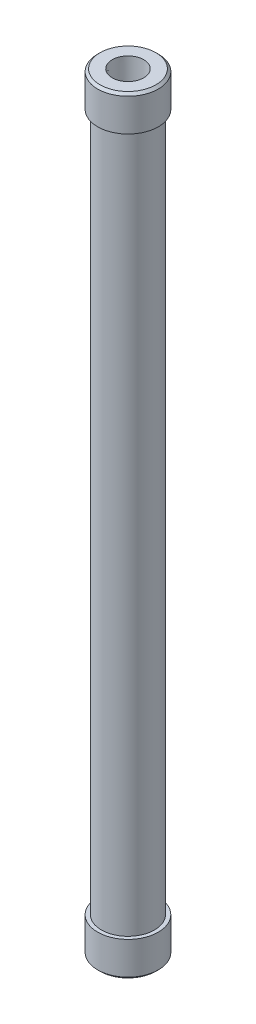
ISO-10303-21;
HEADER;
FILE_DESCRIPTION(('STEP AP214'),'2;1');
FILE_NAME('part.step','',(''),(''),'','','');
FILE_SCHEMA(('AUTOMOTIVE_DESIGN { 1 0 10303 214 1 1 1 1 }'));
ENDSEC;
DATA;
#1=APPLICATION_CONTEXT('core data for automotive mechanical design processes');
#2=APPLICATION_PROTOCOL_DEFINITION('international standard','automotive_design',2000,#1);
#3=PRODUCT_CONTEXT('',#1,'mechanical');
#4=PRODUCT('Part','Part','',(#3));
#5=PRODUCT_RELATED_PRODUCT_CATEGORY('part','',(#4));
#6=PRODUCT_DEFINITION_FORMATION('','',#4);
#7=PRODUCT_DEFINITION_CONTEXT('part definition',#1,'design');
#8=PRODUCT_DEFINITION('design','',#6,#7);
#9=PRODUCT_DEFINITION_SHAPE('','',#8);
#10=(LENGTH_UNIT() NAMED_UNIT(*) SI_UNIT(.MILLI.,.METRE.));
#11=(NAMED_UNIT(*) PLANE_ANGLE_UNIT() SI_UNIT($,.RADIAN.));
#12=(NAMED_UNIT(*) SI_UNIT($,.STERADIAN.) SOLID_ANGLE_UNIT());
#13=UNCERTAINTY_MEASURE_WITH_UNIT(LENGTH_MEASURE(1.E-05),#10,'distance_accuracy_value','');
#14=(GEOMETRIC_REPRESENTATION_CONTEXT(3) GLOBAL_UNCERTAINTY_ASSIGNED_CONTEXT((#13)) GLOBAL_UNIT_ASSIGNED_CONTEXT((#10,
#11,#12)) REPRESENTATION_CONTEXT('',''));
#15=CARTESIAN_POINT('',(0.,0.,0.));
#16=DIRECTION('',(0.,0.,1.));
#17=DIRECTION('',(1.,0.,0.));
#18=AXIS2_PLACEMENT_3D('',#15,#16,#17);
#19=CARTESIAN_POINT('',(0.,482.6,0.));
#20=DIRECTION('',(0.,-1.,0.));
#21=DIRECTION('',(0.,0.,-1.));
#22=AXIS2_PLACEMENT_3D('',#19,#20,#21);
#23=CYLINDRICAL_SURFACE('',#22,16.7005);
#24=CARTESIAN_POINT('',(0.,22.098,0.));
#25=DIRECTION('',(0.,1.,0.));
#26=DIRECTION('',(0.,0.,1.));
#27=AXIS2_PLACEMENT_3D('',#24,#25,#26);
#28=CIRCLE('',#27,16.7005);
#29=CARTESIAN_POINT('',(0.,22.0979999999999,-16.7005));
#30=VERTEX_POINT('',#29);
#31=EDGE_CURVE('E71',#30,#30,#28,.T.);
#32=CARTESIAN_POINT('',(0.,460.502,0.));
#33=DIRECTION('',(0.,1.,0.));
#34=DIRECTION('',(0.,0.,1.));
#35=AXIS2_PLACEMENT_3D('',#32,#33,#34);
#36=CIRCLE('',#35,16.7005);
#37=CARTESIAN_POINT('',(0.,460.502,-16.7005));
#38=VERTEX_POINT('',#37);
#39=EDGE_CURVE('E53',#38,#38,#36,.T.);
#40=CARTESIAN_POINT('',(0.,22.0979999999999,-16.7005));
#41=CARTESIAN_POINT('',(0.,26.6647083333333,-16.7005));
#42=CARTESIAN_POINT('',(0.,31.2314166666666,-16.7005));
#43=CARTESIAN_POINT('',(0.,40.3648333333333,-16.7005));
#44=CARTESIAN_POINT('',(0.,44.9315416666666,-16.7005));
#45=CARTESIAN_POINT('',(0.,54.0649583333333,-16.7005));
#46=CARTESIAN_POINT('',(0.,58.6316666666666,-16.7005));
#47=CARTESIAN_POINT('',(0.,67.7650833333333,-16.7005));
#48=CARTESIAN_POINT('',(0.,72.3317916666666,-16.7005));
#49=CARTESIAN_POINT('',(0.,81.4652083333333,-16.7005));
#50=CARTESIAN_POINT('',(0.,86.0319166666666,-16.7005));
#51=CARTESIAN_POINT('',(0.,95.1653333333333,-16.7005));
#52=CARTESIAN_POINT('',(0.,99.7320416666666,-16.7005));
#53=CARTESIAN_POINT('',(0.,108.865458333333,-16.7005));
#54=CARTESIAN_POINT('',(0.,113.432166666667,-16.7005));
#55=CARTESIAN_POINT('',(0.,122.565583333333,-16.7005));
#56=CARTESIAN_POINT('',(0.,127.132291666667,-16.7005));
#57=CARTESIAN_POINT('',(0.,136.265708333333,-16.7005));
#58=CARTESIAN_POINT('',(0.,140.832416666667,-16.7005));
#59=CARTESIAN_POINT('',(0.,149.965833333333,-16.7005));
#60=CARTESIAN_POINT('',(0.,154.532541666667,-16.7005));
#61=CARTESIAN_POINT('',(0.,163.665958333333,-16.7005));
#62=CARTESIAN_POINT('',(0.,168.232666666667,-16.7005));
#63=CARTESIAN_POINT('',(0.,177.366083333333,-16.7005));
#64=CARTESIAN_POINT('',(0.,181.932791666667,-16.7005));
#65=CARTESIAN_POINT('',(0.,191.066208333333,-16.7005));
#66=CARTESIAN_POINT('',(0.,195.632916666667,-16.7005));
#67=CARTESIAN_POINT('',(0.,204.766333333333,-16.7005));
#68=CARTESIAN_POINT('',(0.,209.333041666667,-16.7005));
#69=CARTESIAN_POINT('',(0.,218.466458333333,-16.7005));
#70=CARTESIAN_POINT('',(0.,223.033166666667,-16.7005));
#71=CARTESIAN_POINT('',(0.,232.166583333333,-16.7005));
#72=CARTESIAN_POINT('',(0.,236.733291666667,-16.7005));
#73=CARTESIAN_POINT('',(0.,245.866708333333,-16.7005));
#74=CARTESIAN_POINT('',(0.,250.433416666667,-16.7005));
#75=CARTESIAN_POINT('',(0.,259.566833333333,-16.7005));
#76=CARTESIAN_POINT('',(0.,264.133541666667,-16.7005));
#77=CARTESIAN_POINT('',(0.,273.266958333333,-16.7005));
#78=CARTESIAN_POINT('',(0.,277.833666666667,-16.7005));
#79=CARTESIAN_POINT('',(0.,286.967083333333,-16.7005));
#80=CARTESIAN_POINT('',(0.,291.533791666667,-16.7005));
#81=CARTESIAN_POINT('',(0.,300.667208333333,-16.7005));
#82=CARTESIAN_POINT('',(0.,305.233916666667,-16.7005));
#83=CARTESIAN_POINT('',(0.,314.367333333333,-16.7005));
#84=CARTESIAN_POINT('',(0.,318.934041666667,-16.7005));
#85=CARTESIAN_POINT('',(0.,328.067458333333,-16.7005));
#86=CARTESIAN_POINT('',(0.,332.634166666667,-16.7005));
#87=CARTESIAN_POINT('',(0.,341.767583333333,-16.7005));
#88=CARTESIAN_POINT('',(0.,346.334291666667,-16.7005));
#89=CARTESIAN_POINT('',(0.,355.467708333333,-16.7005));
#90=CARTESIAN_POINT('',(0.,360.034416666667,-16.7005));
#91=CARTESIAN_POINT('',(0.,369.167833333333,-16.7005));
#92=CARTESIAN_POINT('',(0.,373.734541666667,-16.7005));
#93=CARTESIAN_POINT('',(0.,382.867958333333,-16.7005));
#94=CARTESIAN_POINT('',(0.,387.434666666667,-16.7005));
#95=CARTESIAN_POINT('',(0.,396.568083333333,-16.7005));
#96=CARTESIAN_POINT('',(0.,401.134791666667,-16.7005));
#97=CARTESIAN_POINT('',(0.,410.268208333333,-16.7005));
#98=CARTESIAN_POINT('',(0.,414.834916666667,-16.7005));
#99=CARTESIAN_POINT('',(0.,423.968333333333,-16.7005));
#100=CARTESIAN_POINT('',(0.,428.535041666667,-16.7005));
#101=CARTESIAN_POINT('',(0.,437.668458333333,-16.7005));
#102=CARTESIAN_POINT('',(0.,442.235166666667,-16.7005));
#103=CARTESIAN_POINT('',(0.,451.368583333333,-16.7005));
#104=CARTESIAN_POINT('',(0.,455.935291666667,-16.7005));
#105=CARTESIAN_POINT('',(0.,460.502,-16.7005));
#106=B_SPLINE_CURVE_WITH_KNOTS('',3,(#40,#41,#42,#43,#44,#45,#46,#47,#48,#49,#50,#51,#52,#53,
#54,#55,#56,#57,#58,#59,#60,#61,#62,#63,#64,#65,#66,#67,#68,#69,#70,#71,#72,#73,#74,#75,#76,#77,
#78,#79,#80,#81,#82,#83,#84,#85,#86,#87,#88,#89,#90,#91,#92,#93,#94,#95,#96,#97,#98,#99,#100,
#101,#102,#103,#104,#105),.UNSPECIFIED.,.F.,.F.,(4,2,2,2,2,2,2,2,2,2,2,2,2,2,2,2,2,2,2,2,2,2,2,
2,2,2,2,2,2,2,2,2,4),(0.,13.700125,27.40025,41.100375,54.8005,68.500625,82.20075,95.900875,
109.601,123.301125,137.00125,150.701375,164.4015,178.101625,191.80175,205.501875,219.202,
232.902125,246.60225,260.302375,274.0025,287.702625,301.40275,315.102875,328.803,342.503125,
356.20325,369.903375,383.6035,397.303625,411.00375,424.703875,438.404),.UNSPECIFIED.);
#107=EDGE_CURVE('BSEAM33',#30,#38,#106,.T.);
#108=ORIENTED_EDGE('',*,*,#31,.T.);
#109=ORIENTED_EDGE('',*,*,#39,.F.);
#110=ORIENTED_EDGE('',*,*,#107,.T.);
#111=ORIENTED_EDGE('',*,*,#107,.F.);
#112=EDGE_LOOP('',(#108,#110,#109,#111));
#113=FACE_BOUND('',#112,.T.);
#114=ADVANCED_FACE('F33',(#113),#23,.T.);
#115=CARTESIAN_POINT('',(0.,22.098,0.));
#116=DIRECTION('',(0.,1.,0.));
#117=DIRECTION('',(0.,0.,1.));
#118=AXIS2_PLACEMENT_3D('',#115,#116,#117);
#119=PLANE('',#118);
#120=CARTESIAN_POINT('',(0.,22.098,0.));
#121=DIRECTION('',(0.,1.,0.));
#122=DIRECTION('',(0.,0.,1.));
#123=AXIS2_PLACEMENT_3D('',#120,#121,#122);
#124=CIRCLE('',#123,19.05);
#125=CARTESIAN_POINT('',(0.,22.098,19.05));
#126=VERTEX_POINT('',#125);
#127=EDGE_CURVE('E67',#126,#126,#124,.T.);
#128=ORIENTED_EDGE('',*,*,#127,.T.);
#129=EDGE_LOOP('',(#128));
#130=FACE_BOUND('',#129,.T.);
#131=ORIENTED_EDGE('',*,*,#31,.F.);
#132=EDGE_LOOP('',(#131));
#133=FACE_BOUND('',#132,.T.);
#134=ADVANCED_FACE('F115',(#130,#133),#119,.T.);
#135=CARTESIAN_POINT('',(0.,22.098,0.));
#136=DIRECTION('',(0.,-1.,0.));
#137=DIRECTION('',(0.,0.,-1.));
#138=AXIS2_PLACEMENT_3D('',#135,#136,#137);
#139=CYLINDRICAL_SURFACE('',#138,19.05);
#140=CARTESIAN_POINT('',(0.,1.52400000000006,0.));
#141=DIRECTION('',(0.,1.,0.));
#142=DIRECTION('',(0.,0.,1.));
#143=AXIS2_PLACEMENT_3D('',#140,#141,#142);
#144=CIRCLE('',#143,19.05);
#145=CARTESIAN_POINT('',(0.,1.52400000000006,19.05));
#146=VERTEX_POINT('',#145);
#147=EDGE_CURVE('E48',#146,#146,#144,.T.);
#148=ORIENTED_EDGE('',*,*,#147,.T.);
#149=EDGE_LOOP('',(#148));
#150=FACE_BOUND('',#149,.T.);
#151=ORIENTED_EDGE('',*,*,#127,.F.);
#152=EDGE_LOOP('',(#151));
#153=FACE_BOUND('',#152,.T.);
#154=ADVANCED_FACE('F121',(#150,#153),#139,.T.);
#155=CARTESIAN_POINT('',(0.,0.,0.));
#156=DIRECTION('',(0.,1.,0.));
#157=DIRECTION('',(0.,0.,1.));
#158=AXIS2_PLACEMENT_3D('',#155,#156,#157);
#159=PLANE('',#158);
#160=CARTESIAN_POINT('',(0.,0.,0.));
#161=DIRECTION('',(0.,1.,0.));
#162=DIRECTION('',(0.,0.,1.));
#163=AXIS2_PLACEMENT_3D('',#160,#161,#162);
#164=CIRCLE('',#163,17.5259999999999);
#165=CARTESIAN_POINT('',(0.,0.,17.5259999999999));
#166=VERTEX_POINT('',#165);
#167=EDGE_CURVE('E44',#166,#166,#164,.F.);
#168=ORIENTED_EDGE('',*,*,#167,.T.);
#169=EDGE_LOOP('',(#168));
#170=FACE_BOUND('',#169,.T.);
#171=CARTESIAN_POINT('',(0.,0.,0.));
#172=DIRECTION('',(0.,-1.,0.));
#173=DIRECTION('',(0.,0.,-1.));
#174=AXIS2_PLACEMENT_3D('',#171,#172,#173);
#175=CIRCLE('',#174,9.896063);
#176=CARTESIAN_POINT('',(0.,0.,-9.896063));
#177=VERTEX_POINT('',#176);
#178=EDGE_CURVE('E57',#177,#177,#175,.T.);
#179=ORIENTED_EDGE('',*,*,#178,.F.);
#180=EDGE_LOOP('',(#179));
#181=FACE_BOUND('',#180,.T.);
#182=ADVANCED_FACE('F126',(#170,#181),#159,.F.);
#183=CARTESIAN_POINT('',(0.,460.502,0.));
#184=DIRECTION('',(0.,1.,0.));
#185=DIRECTION('',(0.,0.,1.));
#186=AXIS2_PLACEMENT_3D('',#183,#184,#185);
#187=PLANE('',#186);
#188=CARTESIAN_POINT('',(0.,460.502,0.));
#189=DIRECTION('',(0.,1.,0.));
#190=DIRECTION('',(0.,0.,1.));
#191=AXIS2_PLACEMENT_3D('',#188,#189,#190);
#192=CIRCLE('',#191,19.05);
#193=CARTESIAN_POINT('',(0.,460.502,19.05));
#194=VERTEX_POINT('',#193);
#195=EDGE_CURVE('E62',#194,#194,#192,.T.);
#196=ORIENTED_EDGE('',*,*,#195,.F.);
#197=EDGE_LOOP('',(#196));
#198=FACE_BOUND('',#197,.T.);
#199=ORIENTED_EDGE('',*,*,#39,.T.);
#200=EDGE_LOOP('',(#199));
#201=FACE_BOUND('',#200,.T.);
#202=ADVANCED_FACE('F110',(#198,#201),#187,.F.);
#203=CARTESIAN_POINT('',(0.,460.502,0.));
#204=DIRECTION('',(0.,1.,0.));
#205=DIRECTION('',(0.,0.,1.));
#206=AXIS2_PLACEMENT_3D('',#203,#204,#205);
#207=CYLINDRICAL_SURFACE('',#206,19.05);
#208=CARTESIAN_POINT('',(0.,481.076,0.));
#209=DIRECTION('',(0.,1.,0.));
#210=DIRECTION('',(0.,0.,1.));
#211=AXIS2_PLACEMENT_3D('',#208,#209,#210);
#212=CIRCLE('',#211,19.05);
#213=CARTESIAN_POINT('',(0.,481.076,-19.05));
#214=VERTEX_POINT('',#213);
#215=EDGE_CURVE('E10',#214,#214,#212,.F.);
#216=ORIENTED_EDGE('',*,*,#215,.T.);
#217=EDGE_LOOP('',(#216));
#218=FACE_BOUND('',#217,.T.);
#219=ORIENTED_EDGE('',*,*,#195,.T.);
#220=EDGE_LOOP('',(#219));
#221=FACE_BOUND('',#220,.T.);
#222=ADVANCED_FACE('F101',(#218,#221),#207,.T.);
#223=CARTESIAN_POINT('',(0.,482.6,0.));
#224=DIRECTION('',(0.,1.,0.));
#225=DIRECTION('',(0.,0.,1.));
#226=AXIS2_PLACEMENT_3D('',#223,#224,#225);
#227=PLANE('',#226);
#228=CARTESIAN_POINT('',(0.,482.6,0.));
#229=DIRECTION('',(0.,1.,0.));
#230=DIRECTION('',(0.,0.,1.));
#231=AXIS2_PLACEMENT_3D('',#228,#229,#230);
#232=CIRCLE('',#231,17.526);
#233=CARTESIAN_POINT('',(0.,482.6,-17.526));
#234=VERTEX_POINT('',#233);
#235=EDGE_CURVE('E40',#234,#234,#232,.T.);
#236=ORIENTED_EDGE('',*,*,#235,.T.);
#237=EDGE_LOOP('',(#236));
#238=FACE_BOUND('',#237,.T.);
#239=CARTESIAN_POINT('',(0.,482.6,0.));
#240=DIRECTION('',(0.,1.,0.));
#241=DIRECTION('',(0.,0.,1.));
#242=AXIS2_PLACEMENT_3D('',#239,#240,#241);
#243=CIRCLE('',#242,9.896063);
#244=CARTESIAN_POINT('',(0.,482.6,9.896063));
#245=VERTEX_POINT('',#244);
#246=EDGE_CURVE('E92',#245,#245,#243,.T.);
#247=ORIENTED_EDGE('',*,*,#246,.F.);
#248=EDGE_LOOP('',(#247));
#249=FACE_BOUND('',#248,.T.);
#250=ADVANCED_FACE('F98',(#238,#249),#227,.T.);
#251=CARTESIAN_POINT('',(0.,0.,0.));
#252=DIRECTION('',(0.,-1.,0.));
#253=DIRECTION('',(0.,0.,-1.));
#254=AXIS2_PLACEMENT_3D('',#251,#252,#253);
#255=CYLINDRICAL_SURFACE('',#254,8.75);
#256=CARTESIAN_POINT('',(0.,22.098,0.));
#257=DIRECTION('',(0.,1.,0.));
#258=DIRECTION('',(0.,0.,1.));
#259=AXIS2_PLACEMENT_3D('',#256,#257,#258);
#260=CIRCLE('',#259,8.75);
#261=CARTESIAN_POINT('',(0.,22.098,8.75));
#262=VERTEX_POINT('',#261);
#263=EDGE_CURVE('E59',#262,#262,#260,.T.);
#264=ORIENTED_EDGE('',*,*,#263,.T.);
#265=EDGE_LOOP('',(#264));
#266=FACE_BOUND('',#265,.T.);
#267=CARTESIAN_POINT('',(0.,14.986,0.));
#268=DIRECTION('',(0.,-1.,0.));
#269=DIRECTION('',(0.,0.,-1.));
#270=AXIS2_PLACEMENT_3D('',#267,#268,#269);
#271=CIRCLE('',#270,8.75);
#272=CARTESIAN_POINT('',(0.,14.986,-8.75));
#273=VERTEX_POINT('',#272);
#274=EDGE_CURVE('E63',#273,#273,#271,.T.);
#275=ORIENTED_EDGE('',*,*,#274,.T.);
#276=EDGE_LOOP('',(#275));
#277=FACE_BOUND('',#276,.T.);
#278=ADVANCED_FACE('F100',(#266,#277),#255,.F.);
#279=CARTESIAN_POINT('',(8.75,14.986,0.));
#280=DIRECTION('',(0.,1.,0.));
#281=DIRECTION('',(0.,0.,1.));
#282=AXIS2_PLACEMENT_3D('',#279,#280,#281);
#283=PLANE('',#282);
#284=ORIENTED_EDGE('',*,*,#274,.F.);
#285=EDGE_LOOP('',(#284));
#286=FACE_BOUND('',#285,.T.);
#287=CARTESIAN_POINT('',(0.,14.986,0.));
#288=DIRECTION('',(0.,-1.,0.));
#289=DIRECTION('',(0.,0.,-1.));
#290=AXIS2_PLACEMENT_3D('',#287,#288,#289);
#291=CIRCLE('',#290,9.42825071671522);
#292=CARTESIAN_POINT('',(0.,14.986,-9.42825071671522));
#293=VERTEX_POINT('',#292);
#294=EDGE_CURVE('E82',#293,#293,#291,.T.);
#295=ORIENTED_EDGE('',*,*,#294,.T.);
#296=EDGE_LOOP('',(#295));
#297=FACE_BOUND('',#296,.T.);
#298=ADVANCED_FACE('F107',(#286,#297),#283,.F.);
#299=CARTESIAN_POINT('',(0.,0.,0.));
#300=DIRECTION('',(0.,-1.,0.));
#301=DIRECTION('',(0.,0.,-1.));
#302=AXIS2_PLACEMENT_3D('',#299,#300,#301);
#303=CONICAL_SURFACE('',#302,9.896063,0.0312064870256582);
#304=ORIENTED_EDGE('',*,*,#294,.F.);
#305=EDGE_LOOP('',(#304));
#306=FACE_BOUND('',#305,.T.);
#307=ORIENTED_EDGE('',*,*,#178,.T.);
#308=EDGE_LOOP('',(#307));
#309=FACE_BOUND('',#308,.T.);
#310=ADVANCED_FACE('F163',(#306,#309),#303,.F.);
#311=ORIENTED_EDGE('',*,*,#263,.F.);
#312=EDGE_LOOP('',(#311));
#313=FACE_BOUND('',#312,.T.);
#314=CARTESIAN_POINT('',(0.,22.098,0.));
#315=DIRECTION('',(0.,1.,0.));
#316=DIRECTION('',(0.,0.,1.));
#317=AXIS2_PLACEMENT_3D('',#314,#315,#316);
#318=CIRCLE('',#317,13.1445);
#319=CARTESIAN_POINT('',(0.,22.0979999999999,-13.1445));
#320=VERTEX_POINT('',#319);
#321=EDGE_CURVE('E68',#320,#320,#318,.T.);
#322=ORIENTED_EDGE('',*,*,#321,.T.);
#323=EDGE_LOOP('',(#322));
#324=FACE_BOUND('',#323,.T.);
#325=ADVANCED_FACE('F124',(#313,#324),#119,.T.);
#326=CARTESIAN_POINT('',(0.,482.6,0.));
#327=DIRECTION('',(0.,-1.,0.));
#328=DIRECTION('',(0.,0.,-1.));
#329=AXIS2_PLACEMENT_3D('',#326,#327,#328);
#330=CYLINDRICAL_SURFACE('',#329,13.1445);
#331=CARTESIAN_POINT('',(0.,460.502,0.));
#332=DIRECTION('',(0.,1.,0.));
#333=DIRECTION('',(0.,0.,1.));
#334=AXIS2_PLACEMENT_3D('',#331,#332,#333);
#335=CIRCLE('',#334,13.1445);
#336=CARTESIAN_POINT('',(0.,460.502,-13.1445));
#337=VERTEX_POINT('',#336);
#338=EDGE_CURVE('E64',#337,#337,#335,.T.);
#339=CARTESIAN_POINT('',(0.,22.0979999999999,-13.1445));
#340=CARTESIAN_POINT('',(0.,26.6647083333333,-13.1445));
#341=CARTESIAN_POINT('',(0.,31.2314166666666,-13.1445));
#342=CARTESIAN_POINT('',(0.,40.3648333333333,-13.1445));
#343=CARTESIAN_POINT('',(0.,44.9315416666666,-13.1445));
#344=CARTESIAN_POINT('',(0.,54.0649583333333,-13.1445));
#345=CARTESIAN_POINT('',(0.,58.6316666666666,-13.1445));
#346=CARTESIAN_POINT('',(0.,67.7650833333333,-13.1445));
#347=CARTESIAN_POINT('',(0.,72.3317916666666,-13.1445));
#348=CARTESIAN_POINT('',(0.,81.4652083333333,-13.1445));
#349=CARTESIAN_POINT('',(0.,86.0319166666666,-13.1445));
#350=CARTESIAN_POINT('',(0.,95.1653333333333,-13.1445));
#351=CARTESIAN_POINT('',(0.,99.7320416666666,-13.1445));
#352=CARTESIAN_POINT('',(0.,108.865458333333,-13.1445));
#353=CARTESIAN_POINT('',(0.,113.432166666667,-13.1445));
#354=CARTESIAN_POINT('',(0.,122.565583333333,-13.1445));
#355=CARTESIAN_POINT('',(0.,127.132291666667,-13.1445));
#356=CARTESIAN_POINT('',(0.,136.265708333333,-13.1445));
#357=CARTESIAN_POINT('',(0.,140.832416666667,-13.1445));
#358=CARTESIAN_POINT('',(0.,149.965833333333,-13.1445));
#359=CARTESIAN_POINT('',(0.,154.532541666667,-13.1445));
#360=CARTESIAN_POINT('',(0.,163.665958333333,-13.1445));
#361=CARTESIAN_POINT('',(0.,168.232666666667,-13.1445));
#362=CARTESIAN_POINT('',(0.,177.366083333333,-13.1445));
#363=CARTESIAN_POINT('',(0.,181.932791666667,-13.1445));
#364=CARTESIAN_POINT('',(0.,191.066208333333,-13.1445));
#365=CARTESIAN_POINT('',(0.,195.632916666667,-13.1445));
#366=CARTESIAN_POINT('',(0.,204.766333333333,-13.1445));
#367=CARTESIAN_POINT('',(0.,209.333041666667,-13.1445));
#368=CARTESIAN_POINT('',(0.,218.466458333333,-13.1445));
#369=CARTESIAN_POINT('',(0.,223.033166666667,-13.1445));
#370=CARTESIAN_POINT('',(0.,232.166583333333,-13.1445));
#371=CARTESIAN_POINT('',(0.,236.733291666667,-13.1445));
#372=CARTESIAN_POINT('',(0.,245.866708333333,-13.1445));
#373=CARTESIAN_POINT('',(0.,250.433416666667,-13.1445));
#374=CARTESIAN_POINT('',(0.,259.566833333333,-13.1445));
#375=CARTESIAN_POINT('',(0.,264.133541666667,-13.1445));
#376=CARTESIAN_POINT('',(0.,273.266958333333,-13.1445));
#377=CARTESIAN_POINT('',(0.,277.833666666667,-13.1445));
#378=CARTESIAN_POINT('',(0.,286.967083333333,-13.1445));
#379=CARTESIAN_POINT('',(0.,291.533791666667,-13.1445));
#380=CARTESIAN_POINT('',(0.,300.667208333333,-13.1445));
#381=CARTESIAN_POINT('',(0.,305.233916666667,-13.1445));
#382=CARTESIAN_POINT('',(0.,314.367333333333,-13.1445));
#383=CARTESIAN_POINT('',(0.,318.934041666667,-13.1445));
#384=CARTESIAN_POINT('',(0.,328.067458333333,-13.1445));
#385=CARTESIAN_POINT('',(0.,332.634166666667,-13.1445));
#386=CARTESIAN_POINT('',(0.,341.767583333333,-13.1445));
#387=CARTESIAN_POINT('',(0.,346.334291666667,-13.1445));
#388=CARTESIAN_POINT('',(0.,355.467708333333,-13.1445));
#389=CARTESIAN_POINT('',(0.,360.034416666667,-13.1445));
#390=CARTESIAN_POINT('',(0.,369.167833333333,-13.1445));
#391=CARTESIAN_POINT('',(0.,373.734541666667,-13.1445));
#392=CARTESIAN_POINT('',(0.,382.867958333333,-13.1445));
#393=CARTESIAN_POINT('',(0.,387.434666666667,-13.1445));
#394=CARTESIAN_POINT('',(0.,396.568083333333,-13.1445));
#395=CARTESIAN_POINT('',(0.,401.134791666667,-13.1445));
#396=CARTESIAN_POINT('',(0.,410.268208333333,-13.1445));
#397=CARTESIAN_POINT('',(0.,414.834916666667,-13.1445));
#398=CARTESIAN_POINT('',(0.,423.968333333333,-13.1445));
#399=CARTESIAN_POINT('',(0.,428.535041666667,-13.1445));
#400=CARTESIAN_POINT('',(0.,437.668458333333,-13.1445));
#401=CARTESIAN_POINT('',(0.,442.235166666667,-13.1445));
#402=CARTESIAN_POINT('',(0.,451.368583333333,-13.1445));
#403=CARTESIAN_POINT('',(0.,455.935291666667,-13.1445));
#404=CARTESIAN_POINT('',(0.,460.502,-13.1445));
#405=B_SPLINE_CURVE_WITH_KNOTS('',3,(#339,#340,#341,#342,#343,#344,#345,#346,#347,#348,#349,
#350,#351,#352,#353,#354,#355,#356,#357,#358,#359,#360,#361,#362,#363,#364,#365,#366,#367,#368,
#369,#370,#371,#372,#373,#374,#375,#376,#377,#378,#379,#380,#381,#382,#383,#384,#385,#386,#387,
#388,#389,#390,#391,#392,#393,#394,#395,#396,#397,#398,#399,#400,#401,#402,#403,#404),
.UNSPECIFIED.,.F.,.F.,(4,2,2,2,2,2,2,2,2,2,2,2,2,2,2,2,2,2,2,2,2,2,2,2,2,2,2,2,2,2,2,2,4),(0.,
13.700125,27.40025,41.100375,54.8005,68.500625,82.20075,95.900875,109.601,123.301125,137.00125,
150.701375,164.4015,178.101625,191.80175,205.501875,219.202,232.902125,246.60225,260.302375,
274.0025,287.702625,301.40275,315.102875,328.803,342.503125,356.20325,369.903375,383.6035,
397.303625,411.00375,424.703875,438.404),.UNSPECIFIED.);
#406=EDGE_CURVE('BSEAM152',#320,#337,#405,.T.);
#407=ORIENTED_EDGE('',*,*,#321,.F.);
#408=ORIENTED_EDGE('',*,*,#338,.T.);
#409=ORIENTED_EDGE('',*,*,#406,.T.);
#410=ORIENTED_EDGE('',*,*,#406,.F.);
#411=EDGE_LOOP('',(#407,#409,#408,#410));
#412=FACE_BOUND('',#411,.T.);
#413=ADVANCED_FACE('F152',(#412),#330,.F.);
#414=CARTESIAN_POINT('',(0.,460.502,0.));
#415=DIRECTION('',(0.,1.,0.));
#416=DIRECTION('',(0.,0.,1.));
#417=AXIS2_PLACEMENT_3D('',#414,#415,#416);
#418=CIRCLE('',#417,8.75);
#419=CARTESIAN_POINT('',(0.,460.502,8.75));
#420=VERTEX_POINT('',#419);
#421=EDGE_CURVE('E54',#420,#420,#418,.T.);
#422=ORIENTED_EDGE('',*,*,#421,.T.);
#423=EDGE_LOOP('',(#422));
#424=FACE_BOUND('',#423,.T.);
#425=ORIENTED_EDGE('',*,*,#338,.F.);
#426=EDGE_LOOP('',(#425));
#427=FACE_BOUND('',#426,.T.);
#428=ADVANCED_FACE('F154',(#424,#427),#187,.F.);
#429=CARTESIAN_POINT('',(0.,482.6,0.));
#430=DIRECTION('',(0.,1.,0.));
#431=DIRECTION('',(0.,0.,1.));
#432=AXIS2_PLACEMENT_3D('',#429,#430,#431);
#433=CYLINDRICAL_SURFACE('',#432,8.75);
#434=CARTESIAN_POINT('',(0.,467.614,0.));
#435=DIRECTION('',(0.,1.,0.));
#436=DIRECTION('',(0.,0.,1.));
#437=AXIS2_PLACEMENT_3D('',#434,#435,#436);
#438=CIRCLE('',#437,8.75);
#439=CARTESIAN_POINT('',(0.,467.614,8.75));
#440=VERTEX_POINT('',#439);
#441=EDGE_CURVE('E58',#440,#440,#438,.T.);
#442=ORIENTED_EDGE('',*,*,#441,.T.);
#443=EDGE_LOOP('',(#442));
#444=FACE_BOUND('',#443,.T.);
#445=ORIENTED_EDGE('',*,*,#421,.F.);
#446=EDGE_LOOP('',(#445));
#447=FACE_BOUND('',#446,.T.);
#448=ADVANCED_FACE('F160',(#444,#447),#433,.F.);
#449=CARTESIAN_POINT('',(8.75,467.614,0.));
#450=DIRECTION('',(0.,-1.,0.));
#451=DIRECTION('',(0.,0.,-1.));
#452=AXIS2_PLACEMENT_3D('',#449,#450,#451);
#453=PLANE('',#452);
#454=ORIENTED_EDGE('',*,*,#441,.F.);
#455=EDGE_LOOP('',(#454));
#456=FACE_BOUND('',#455,.T.);
#457=CARTESIAN_POINT('',(0.,467.614,0.));
#458=DIRECTION('',(0.,1.,0.));
#459=DIRECTION('',(0.,0.,1.));
#460=AXIS2_PLACEMENT_3D('',#457,#458,#459);
#461=CIRCLE('',#460,9.42825071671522);
#462=CARTESIAN_POINT('',(0.,467.614,9.42825071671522));
#463=VERTEX_POINT('',#462);
#464=EDGE_CURVE('E89',#463,#463,#461,.T.);
#465=ORIENTED_EDGE('',*,*,#464,.T.);
#466=EDGE_LOOP('',(#465));
#467=FACE_BOUND('',#466,.T.);
#468=ADVANCED_FACE('F135',(#456,#467),#453,.F.);
#469=CARTESIAN_POINT('',(0.,482.6,0.));
#470=DIRECTION('',(0.,1.,0.));
#471=DIRECTION('',(0.,0.,1.));
#472=AXIS2_PLACEMENT_3D('',#469,#470,#471);
#473=CONICAL_SURFACE('',#472,9.896063,0.0312064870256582);
#474=ORIENTED_EDGE('',*,*,#464,.F.);
#475=EDGE_LOOP('',(#474));
#476=FACE_BOUND('',#475,.T.);
#477=ORIENTED_EDGE('',*,*,#246,.T.);
#478=EDGE_LOOP('',(#477));
#479=FACE_BOUND('',#478,.T.);
#480=ADVANCED_FACE('F96',(#476,#479),#473,.F.);
#481=CARTESIAN_POINT('',(0.,1.52400000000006,0.));
#482=DIRECTION('',(0.,1.,0.));
#483=DIRECTION('',(0.,0.,1.));
#484=AXIS2_PLACEMENT_3D('',#481,#482,#483);
#485=CONICAL_SURFACE('',#484,19.05,0.785398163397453);
#486=ORIENTED_EDGE('',*,*,#167,.F.);
#487=EDGE_LOOP('',(#486));
#488=FACE_BOUND('',#487,.T.);
#489=ORIENTED_EDGE('',*,*,#147,.F.);
#490=EDGE_LOOP('',(#489));
#491=FACE_BOUND('',#490,.T.);
#492=ADVANCED_FACE('F127',(#488,#491),#485,.T.);
#493=CARTESIAN_POINT('',(0.,482.6,0.));
#494=DIRECTION('',(0.,-1.,0.));
#495=DIRECTION('',(0.,0.,-1.));
#496=AXIS2_PLACEMENT_3D('',#493,#494,#495);
#497=CONICAL_SURFACE('',#496,17.526,0.785398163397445);
#498=CARTESIAN_POINT('',(0.,481.076,-19.05));
#499=CARTESIAN_POINT('',(0.,481.091875,-19.034125));
#500=CARTESIAN_POINT('',(0.,481.10775,-19.01825));
#501=CARTESIAN_POINT('',(0.,481.1395,-18.9865));
#502=CARTESIAN_POINT('',(0.,481.155375,-18.970625));
#503=CARTESIAN_POINT('',(0.,481.187125,-18.938875));
#504=CARTESIAN_POINT('',(0.,481.203,-18.923));
#505=CARTESIAN_POINT('',(0.,481.23475,-18.89125));
#506=CARTESIAN_POINT('',(0.,481.250625,-18.875375));
#507=CARTESIAN_POINT('',(0.,481.282375,-18.843625));
#508=CARTESIAN_POINT('',(0.,481.29825,-18.82775));
#509=CARTESIAN_POINT('',(0.,481.33,-18.796));
#510=CARTESIAN_POINT('',(0.,481.345875,-18.780125));
#511=CARTESIAN_POINT('',(0.,481.377625,-18.748375));
#512=CARTESIAN_POINT('',(0.,481.3935,-18.7325));
#513=CARTESIAN_POINT('',(0.,481.42525,-18.70075));
#514=CARTESIAN_POINT('',(0.,481.441125,-18.684875));
#515=CARTESIAN_POINT('',(0.,481.472875,-18.653125));
#516=CARTESIAN_POINT('',(0.,481.48875,-18.63725));
#517=CARTESIAN_POINT('',(0.,481.5205,-18.6055));
#518=CARTESIAN_POINT('',(0.,481.536375,-18.589625));
#519=CARTESIAN_POINT('',(0.,481.568125,-18.557875));
#520=CARTESIAN_POINT('',(0.,481.584,-18.542));
#521=CARTESIAN_POINT('',(0.,481.61575,-18.51025));
#522=CARTESIAN_POINT('',(0.,481.631625,-18.494375));
#523=CARTESIAN_POINT('',(0.,481.663375,-18.462625));
#524=CARTESIAN_POINT('',(0.,481.67925,-18.44675));
#525=CARTESIAN_POINT('',(0.,481.711,-18.415));
#526=CARTESIAN_POINT('',(0.,481.726875,-18.399125));
#527=CARTESIAN_POINT('',(0.,481.758625,-18.367375));
#528=CARTESIAN_POINT('',(0.,481.7745,-18.3515));
#529=CARTESIAN_POINT('',(0.,481.80625,-18.31975));
#530=CARTESIAN_POINT('',(0.,481.822125,-18.303875));
#531=CARTESIAN_POINT('',(0.,481.853875,-18.272125));
#532=CARTESIAN_POINT('',(0.,481.86975,-18.25625));
#533=CARTESIAN_POINT('',(0.,481.9015,-18.2245));
#534=CARTESIAN_POINT('',(0.,481.917375,-18.208625));
#535=CARTESIAN_POINT('',(0.,481.949125,-18.176875));
#536=CARTESIAN_POINT('',(0.,481.965,-18.161));
#537=CARTESIAN_POINT('',(0.,481.99675,-18.12925));
#538=CARTESIAN_POINT('',(0.,482.012625,-18.113375));
#539=CARTESIAN_POINT('',(0.,482.044375,-18.081625));
#540=CARTESIAN_POINT('',(0.,482.06025,-18.06575));
#541=CARTESIAN_POINT('',(0.,482.092,-18.034));
#542=CARTESIAN_POINT('',(0.,482.107875,-18.018125));
#543=CARTESIAN_POINT('',(0.,482.139625,-17.986375));
#544=CARTESIAN_POINT('',(0.,482.1555,-17.9705));
#545=CARTESIAN_POINT('',(0.,482.18725,-17.93875));
#546=CARTESIAN_POINT('',(0.,482.203125,-17.922875));
#547=CARTESIAN_POINT('',(0.,482.234875,-17.891125));
#548=CARTESIAN_POINT('',(0.,482.25075,-17.87525));
#549=CARTESIAN_POINT('',(0.,482.2825,-17.8435));
#550=CARTESIAN_POINT('',(0.,482.298375,-17.827625));
#551=CARTESIAN_POINT('',(0.,482.330125,-17.795875));
#552=CARTESIAN_POINT('',(0.,482.346,-17.78));
#553=CARTESIAN_POINT('',(0.,482.37775,-17.74825));
#554=CARTESIAN_POINT('',(0.,482.393625,-17.732375));
#555=CARTESIAN_POINT('',(0.,482.425375,-17.700625));
#556=CARTESIAN_POINT('',(0.,482.44125,-17.68475));
#557=CARTESIAN_POINT('',(0.,482.473,-17.653));
#558=CARTESIAN_POINT('',(0.,482.488875,-17.637125));
#559=CARTESIAN_POINT('',(0.,482.520625,-17.605375));
#560=CARTESIAN_POINT('',(0.,482.5365,-17.5895));
#561=CARTESIAN_POINT('',(0.,482.56825,-17.55775));
#562=CARTESIAN_POINT('',(0.,482.584125,-17.541875));
#563=CARTESIAN_POINT('',(0.,482.6,-17.526));
#564=B_SPLINE_CURVE_WITH_KNOTS('',3,(#498,#499,#500,#501,#502,#503,#504,#505,#506,#507,#508,
#509,#510,#511,#512,#513,#514,#515,#516,#517,#518,#519,#520,#521,#522,#523,#524,#525,#526,#527,
#528,#529,#530,#531,#532,#533,#534,#535,#536,#537,#538,#539,#540,#541,#542,#543,#544,#545,#546,
#547,#548,#549,#550,#551,#552,#553,#554,#555,#556,#557,#558,#559,#560,#561,#562,#563),
.UNSPECIFIED.,.F.,.F.,(4,2,2,2,2,2,2,2,2,2,2,2,2,2,2,2,2,2,2,2,2,2,2,2,2,2,2,2,2,2,2,2,4),(0.,
0.0673519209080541,0.134703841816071,0.202055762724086,0.269407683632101,0.336759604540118,
0.404111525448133,0.471463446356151,0.538815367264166,0.606167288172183,0.673519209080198,
0.740871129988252,0.808223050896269,0.875574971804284,0.942926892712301,1.01027881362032,
1.07763073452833,1.14498265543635,1.21233457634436,1.27968649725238,1.3470384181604,
1.41439033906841,1.48174225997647,1.54909418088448,1.6164461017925,1.68379802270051,
1.75114994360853,1.81850186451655,1.88585378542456,1.95320570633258,2.02055762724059,
2.08790954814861,2.15526146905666),.UNSPECIFIED.);
#565=EDGE_CURVE('BSEAM35',#214,#234,#564,.T.);
#566=ORIENTED_EDGE('',*,*,#215,.F.);
#567=ORIENTED_EDGE('',*,*,#235,.F.);
#568=ORIENTED_EDGE('',*,*,#565,.T.);
#569=ORIENTED_EDGE('',*,*,#565,.F.);
#570=EDGE_LOOP('',(#566,#568,#567,#569));
#571=FACE_BOUND('',#570,.T.);
#572=ADVANCED_FACE('F35',(#571),#497,.T.);
#573=CLOSED_SHELL('',(#114,#134,#154,#182,#202,#222,#250,#278,#298,#310,#325,#413,#428,#448,
#468,#480,#492,#572));
#574=MANIFOLD_SOLID_BREP('B2',#573);
#575=ADVANCED_BREP_SHAPE_REPRESENTATION('',(#18,#574),#14);
#576=SHAPE_DEFINITION_REPRESENTATION(#9,#575);
ENDSEC;
END-ISO-10303-21;
